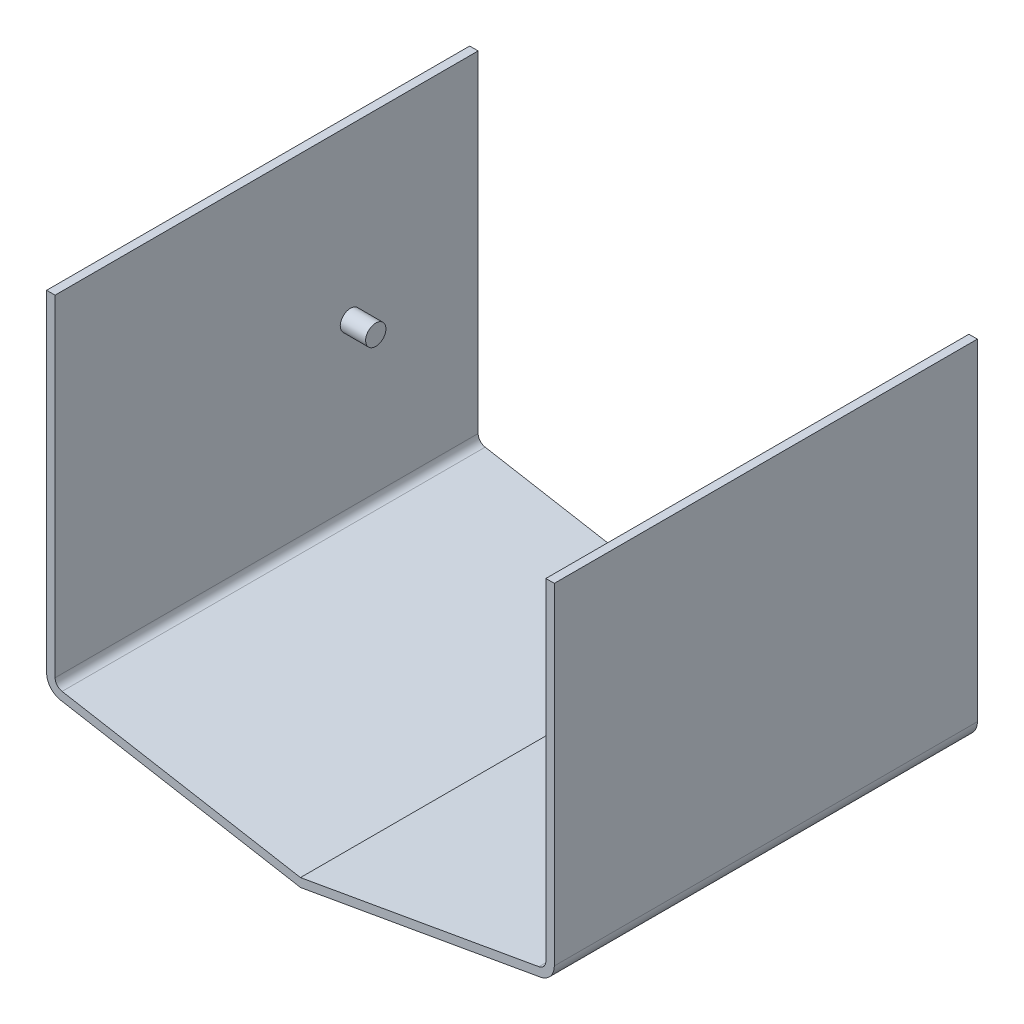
from build123d import *

# Parameters (mm, degrees)
BASE_EXTRUSION_DEPTH = 500
ESQUISSE2_R          = 12
BOSS_EXTRU_1_DEPTH   = 30


with BuildPart() as part:
    # Esquisse1 → Base-Extrusion (new body)
    with BuildSketch(Plane.XY):
        with BuildLine():
            Line((-290, 0), (-290, -391.609003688))
            ThreePointArc((-290, -391.609003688), (-287.660444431, -398.036879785), (-281.736481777, -401.457081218))
            Line((-281.736481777, -401.457081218), (0, -451.134824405))
            Line((0, -451.134824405), (281.736481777, -401.457081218))
            ThreePointArc((281.736481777, -401.457081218), (287.660444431, -398.036879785), (290, -391.609003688))
            Line((290, -391.609003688), (290, 0))
            Line((290, 0), (300, 0))
            Line((300, 0), (300, -391.609003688))
            ThreePointArc((300, -391.609003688), (295.320888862, -404.464755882), (283.472963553, -411.305158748))
            Line((283.472963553, -411.305158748), (0, -461.289090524))
            Line((0, -461.289090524), (-283.472963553, -411.305158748))
            ThreePointArc((-283.472963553, -411.305158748), (-295.320888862, -404.464755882), (-300, -391.609003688))
            Line((-300, -391.609003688), (-300, 0))
            Line((-300, 0), (-290, 0))
        make_face()
    extrude(amount=BASE_EXTRUSION_DEPTH)

    # Esquisse2 → Boss.-Extru.1 (add)
    with BuildSketch(Plane(origin=(-290, 0, 0), x_dir=(0, 0, -1), z_dir=(1, 0, 0))):
        with Locations(Location((-151, -200, 0), (0, 0, 270))):
            Circle(ESQUISSE2_R)
    boss_extru_1 = extrude(amount=BOSS_EXTRU_1_DEPTH)

    # Sym_trie1: Boss.-Extru.1 across plane
    add(boss_extru_1.mirror(Plane(origin=(0, 0, 0), x_dir=(0, 0, 1), z_dir=(1, 0, 0))))


solid = part.part
